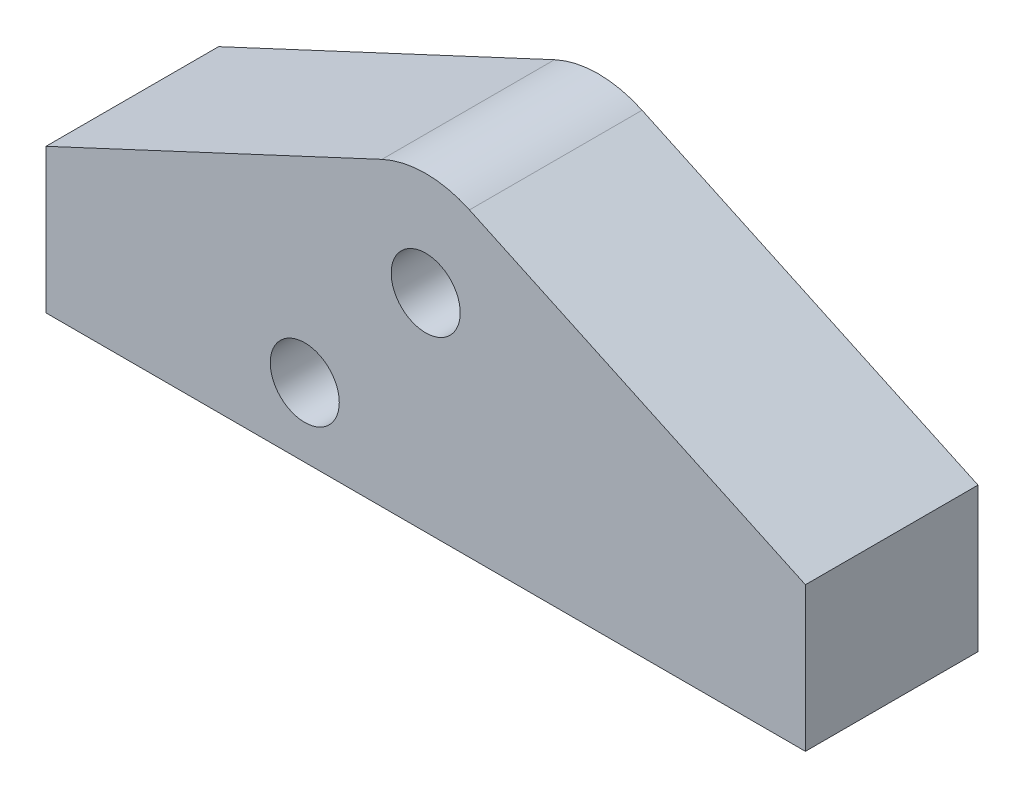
ISO-10303-21;
HEADER;
FILE_DESCRIPTION(('STEP AP214'),'2;1');
FILE_NAME('part.step','',(''),(''),'','','');
FILE_SCHEMA(('AUTOMOTIVE_DESIGN { 1 0 10303 214 1 1 1 1 }'));
ENDSEC;
DATA;
#1=APPLICATION_CONTEXT('core data for automotive mechanical design processes');
#2=APPLICATION_PROTOCOL_DEFINITION('international standard','automotive_design',2000,#1);
#3=PRODUCT_CONTEXT('',#1,'mechanical');
#4=PRODUCT('Part','Part','',(#3));
#5=PRODUCT_RELATED_PRODUCT_CATEGORY('part','',(#4));
#6=PRODUCT_DEFINITION_FORMATION('','',#4);
#7=PRODUCT_DEFINITION_CONTEXT('part definition',#1,'design');
#8=PRODUCT_DEFINITION('design','',#6,#7);
#9=PRODUCT_DEFINITION_SHAPE('','',#8);
#10=(LENGTH_UNIT() NAMED_UNIT(*) SI_UNIT(.MILLI.,.METRE.));
#11=(NAMED_UNIT(*) PLANE_ANGLE_UNIT() SI_UNIT($,.RADIAN.));
#12=(NAMED_UNIT(*) SI_UNIT($,.STERADIAN.) SOLID_ANGLE_UNIT());
#13=UNCERTAINTY_MEASURE_WITH_UNIT(LENGTH_MEASURE(1.E-05),#10,'distance_accuracy_value','');
#14=(GEOMETRIC_REPRESENTATION_CONTEXT(3) GLOBAL_UNCERTAINTY_ASSIGNED_CONTEXT((#13)) GLOBAL_UNIT_ASSIGNED_CONTEXT((#10,
#11,#12)) REPRESENTATION_CONTEXT('',''));
#15=CARTESIAN_POINT('',(0.,0.,0.));
#16=DIRECTION('',(0.,0.,1.));
#17=DIRECTION('',(1.,0.,0.));
#18=AXIS2_PLACEMENT_3D('',#15,#16,#17);
#19=CARTESIAN_POINT('',(-34.925,-19.05,-6.35));
#20=DIRECTION('',(-1.,0.,0.));
#21=DIRECTION('',(0.,0.,1.));
#22=AXIS2_PLACEMENT_3D('',#19,#20,#21);
#23=PLANE('',#22);
#24=DIRECTION('',(0.,0.,1.));
#25=VECTOR('',#24,1.);
#26=CARTESIAN_POINT('',(-34.925,-19.05,-6.35));
#27=LINE('',#26,#25);
#28=CARTESIAN_POINT('',(-34.925,-19.05,-6.35));
#29=VERTEX_POINT('',#28);
#30=CARTESIAN_POINT('',(-34.925,-19.05,9.525));
#31=VERTEX_POINT('',#30);
#32=EDGE_CURVE('E36',#29,#31,#27,.T.);
#33=ORIENTED_EDGE('',*,*,#32,.T.);
#34=DIRECTION('',(0.,-1.,0.));
#35=VECTOR('',#34,1.);
#36=CARTESIAN_POINT('',(-34.925,-19.05,9.525));
#37=LINE('',#36,#35);
#38=CARTESIAN_POINT('',(-34.925,-5.77612028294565,9.525));
#39=VERTEX_POINT('',#38);
#40=EDGE_CURVE('E85',#39,#31,#37,.T.);
#41=ORIENTED_EDGE('',*,*,#40,.F.);
#42=DIRECTION('',(0.,0.,1.));
#43=VECTOR('',#42,1.);
#44=CARTESIAN_POINT('',(-34.925,-5.77612028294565,-6.35));
#45=LINE('',#44,#43);
#46=CARTESIAN_POINT('',(-34.925,-5.77612028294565,-6.35));
#47=VERTEX_POINT('',#46);
#48=EDGE_CURVE('E11',#47,#39,#45,.T.);
#49=ORIENTED_EDGE('',*,*,#48,.F.);
#50=DIRECTION('',(0.,-1.,0.));
#51=VECTOR('',#50,1.);
#52=CARTESIAN_POINT('',(-34.925,-19.05,-6.35));
#53=LINE('',#52,#51);
#54=EDGE_CURVE('E86',#47,#29,#53,.T.);
#55=ORIENTED_EDGE('',*,*,#54,.T.);
#56=EDGE_LOOP('',(#33,#41,#49,#55));
#57=FACE_BOUND('',#56,.T.);
#58=ADVANCED_FACE('F33',(#57),#23,.T.);
#59=CARTESIAN_POINT('',(-34.925,-5.77612028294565,-6.35));
#60=DIRECTION('',(-0.422618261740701,0.906307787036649,0.));
#61=DIRECTION('',(-0.906307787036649,-0.422618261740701,0.));
#62=AXIS2_PLACEMENT_3D('',#59,#60,#61);
#63=PLANE('',#62);
#64=ORIENTED_EDGE('',*,*,#48,.T.);
#65=DIRECTION('',(-0.906307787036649,-0.422618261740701,0.));
#66=VECTOR('',#65,1.);
#67=CARTESIAN_POINT('',(-34.925,-5.77612028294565,9.525));
#68=LINE('',#67,#66);
#69=CARTESIAN_POINT('',(-4.02543894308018,8.63258167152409,9.525));
#70=VERTEX_POINT('',#69);
#71=EDGE_CURVE('E104',#70,#39,#68,.T.);
#72=ORIENTED_EDGE('',*,*,#71,.F.);
#73=DIRECTION('',(0.,0.,1.));
#74=VECTOR('',#73,1.);
#75=CARTESIAN_POINT('',(-4.02543894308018,8.63258167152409,-6.35));
#76=LINE('',#75,#74);
#77=CARTESIAN_POINT('',(-4.02543894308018,8.63258167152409,-6.35));
#78=VERTEX_POINT('',#77);
#79=EDGE_CURVE('E41',#78,#70,#76,.T.);
#80=ORIENTED_EDGE('',*,*,#79,.F.);
#81=DIRECTION('',(-0.906307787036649,-0.422618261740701,0.));
#82=VECTOR('',#81,1.);
#83=CARTESIAN_POINT('',(-34.925,-5.77612028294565,-6.35));
#84=LINE('',#83,#82);
#85=EDGE_CURVE('E91',#78,#47,#84,.T.);
#86=ORIENTED_EDGE('',*,*,#85,.T.);
#87=EDGE_LOOP('',(#64,#72,#80,#86));
#88=FACE_BOUND('',#87,.T.);
#89=ADVANCED_FACE('F155',(#88),#63,.T.);
#90=CARTESIAN_POINT('',(0.,0.,-6.35));
#91=DIRECTION('',(0.,0.,1.));
#92=DIRECTION('',(1.,0.,0.));
#93=AXIS2_PLACEMENT_3D('',#90,#91,#92);
#94=CYLINDRICAL_SURFACE('',#93,9.525);
#95=ORIENTED_EDGE('',*,*,#79,.T.);
#96=CARTESIAN_POINT('',(0.,0.,9.525));
#97=DIRECTION('',(0.,0.,1.));
#98=DIRECTION('',(1.,0.,0.));
#99=AXIS2_PLACEMENT_3D('',#96,#97,#98);
#100=CIRCLE('',#99,9.525);
#101=CARTESIAN_POINT('',(4.02543894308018,8.63258167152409,9.525));
#102=VERTEX_POINT('',#101);
#103=EDGE_CURVE('E116',#102,#70,#100,.T.);
#104=ORIENTED_EDGE('',*,*,#103,.F.);
#105=DIRECTION('',(0.,0.,1.));
#106=VECTOR('',#105,1.);
#107=CARTESIAN_POINT('',(4.02543894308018,8.63258167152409,-6.35));
#108=LINE('',#107,#106);
#109=CARTESIAN_POINT('',(4.02543894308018,8.63258167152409,-6.35));
#110=VERTEX_POINT('',#109);
#111=EDGE_CURVE('E138',#110,#102,#108,.T.);
#112=ORIENTED_EDGE('',*,*,#111,.F.);
#113=CARTESIAN_POINT('',(0.,0.,-6.35));
#114=DIRECTION('',(0.,0.,1.));
#115=DIRECTION('',(1.,0.,0.));
#116=AXIS2_PLACEMENT_3D('',#113,#114,#115);
#117=CIRCLE('',#116,9.525);
#118=EDGE_CURVE('E134',#110,#78,#117,.T.);
#119=ORIENTED_EDGE('',*,*,#118,.T.);
#120=EDGE_LOOP('',(#95,#104,#112,#119));
#121=FACE_BOUND('',#120,.T.);
#122=ADVANCED_FACE('F151',(#121),#94,.T.);
#123=CARTESIAN_POINT('',(34.925,-5.77612028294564,-6.35));
#124=DIRECTION('',(0.422618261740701,0.906307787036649,0.));
#125=DIRECTION('',(-0.906307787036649,0.422618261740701,0.));
#126=AXIS2_PLACEMENT_3D('',#123,#124,#125);
#127=PLANE('',#126);
#128=ORIENTED_EDGE('',*,*,#111,.T.);
#129=DIRECTION('',(-0.906307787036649,0.422618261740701,0.));
#130=VECTOR('',#129,1.);
#131=CARTESIAN_POINT('',(34.925,-5.77612028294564,9.525));
#132=LINE('',#131,#130);
#133=CARTESIAN_POINT('',(34.925,-5.77612028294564,9.525));
#134=VERTEX_POINT('',#133);
#135=EDGE_CURVE('E113',#134,#102,#132,.T.);
#136=ORIENTED_EDGE('',*,*,#135,.F.);
#137=DIRECTION('',(0.,0.,1.));
#138=VECTOR('',#137,1.);
#139=CARTESIAN_POINT('',(34.925,-5.77612028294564,-6.35));
#140=LINE('',#139,#138);
#141=CARTESIAN_POINT('',(34.925,-5.77612028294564,-6.35));
#142=VERTEX_POINT('',#141);
#143=EDGE_CURVE('E140',#142,#134,#140,.T.);
#144=ORIENTED_EDGE('',*,*,#143,.F.);
#145=DIRECTION('',(-0.906307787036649,0.422618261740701,0.));
#146=VECTOR('',#145,1.);
#147=CARTESIAN_POINT('',(34.925,-5.77612028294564,-6.35));
#148=LINE('',#147,#146);
#149=EDGE_CURVE('E131',#142,#110,#148,.T.);
#150=ORIENTED_EDGE('',*,*,#149,.T.);
#151=EDGE_LOOP('',(#128,#136,#144,#150));
#152=FACE_BOUND('',#151,.T.);
#153=ADVANCED_FACE('F148',(#152),#127,.T.);
#154=CARTESIAN_POINT('',(34.925,-19.05,-6.35));
#155=DIRECTION('',(1.,0.,0.));
#156=DIRECTION('',(0.,0.,-1.));
#157=AXIS2_PLACEMENT_3D('',#154,#155,#156);
#158=PLANE('',#157);
#159=ORIENTED_EDGE('',*,*,#143,.T.);
#160=DIRECTION('',(0.,1.,0.));
#161=VECTOR('',#160,1.);
#162=CARTESIAN_POINT('',(34.925,-19.05,9.525));
#163=LINE('',#162,#161);
#164=CARTESIAN_POINT('',(34.925,-19.05,9.525));
#165=VERTEX_POINT('',#164);
#166=EDGE_CURVE('E98',#165,#134,#163,.T.);
#167=ORIENTED_EDGE('',*,*,#166,.F.);
#168=DIRECTION('',(0.,0.,1.));
#169=VECTOR('',#168,1.);
#170=CARTESIAN_POINT('',(34.925,-19.05,-6.35));
#171=LINE('',#170,#169);
#172=CARTESIAN_POINT('',(34.925,-19.05,-6.35));
#173=VERTEX_POINT('',#172);
#174=EDGE_CURVE('E90',#173,#165,#171,.T.);
#175=ORIENTED_EDGE('',*,*,#174,.F.);
#176=DIRECTION('',(0.,1.,0.));
#177=VECTOR('',#176,1.);
#178=CARTESIAN_POINT('',(34.925,-19.05,-6.35));
#179=LINE('',#178,#177);
#180=EDGE_CURVE('E128',#173,#142,#179,.T.);
#181=ORIENTED_EDGE('',*,*,#180,.T.);
#182=EDGE_LOOP('',(#159,#167,#175,#181));
#183=FACE_BOUND('',#182,.T.);
#184=ADVANCED_FACE('F142',(#183),#158,.T.);
#185=CARTESIAN_POINT('',(-34.925,-19.05,-6.35));
#186=DIRECTION('',(0.,-1.,0.));
#187=DIRECTION('',(1.,0.,0.));
#188=AXIS2_PLACEMENT_3D('',#185,#186,#187);
#189=PLANE('',#188);
#190=CARTESIAN_POINT('',(25.4,-19.05,0.));
#191=DIRECTION('',(0.,-1.,0.));
#192=DIRECTION('',(1.,0.,0.));
#193=AXIS2_PLACEMENT_3D('',#190,#191,#192);
#194=CIRCLE('',#193,3.175);
#195=CARTESIAN_POINT('',(28.575,-19.05,0.));
#196=VERTEX_POINT('',#195);
#197=EDGE_CURVE('E179',#196,#196,#194,.T.);
#198=ORIENTED_EDGE('',*,*,#197,.F.);
#199=EDGE_LOOP('',(#198));
#200=FACE_BOUND('',#199,.T.);
#201=CARTESIAN_POINT('',(-25.4,-19.05,0.));
#202=DIRECTION('',(0.,-1.,0.));
#203=DIRECTION('',(1.,0.,0.));
#204=AXIS2_PLACEMENT_3D('',#201,#202,#203);
#205=CIRCLE('',#204,3.175);
#206=CARTESIAN_POINT('',(-22.225,-19.05,0.));
#207=VERTEX_POINT('',#206);
#208=EDGE_CURVE('E182',#207,#207,#205,.T.);
#209=ORIENTED_EDGE('',*,*,#208,.F.);
#210=EDGE_LOOP('',(#209));
#211=FACE_BOUND('',#210,.T.);
#212=ORIENTED_EDGE('',*,*,#174,.T.);
#213=DIRECTION('',(1.,0.,0.));
#214=VECTOR('',#213,1.);
#215=CARTESIAN_POINT('',(-34.925,-19.05,9.525));
#216=LINE('',#215,#214);
#217=EDGE_CURVE('E93',#31,#165,#216,.T.);
#218=ORIENTED_EDGE('',*,*,#217,.F.);
#219=ORIENTED_EDGE('',*,*,#32,.F.);
#220=DIRECTION('',(1.,0.,0.));
#221=VECTOR('',#220,1.);
#222=CARTESIAN_POINT('',(-34.925,-19.05,-6.35));
#223=LINE('',#222,#221);
#224=EDGE_CURVE('E126',#29,#173,#223,.T.);
#225=ORIENTED_EDGE('',*,*,#224,.T.);
#226=EDGE_LOOP('',(#212,#218,#219,#225));
#227=FACE_BOUND('',#226,.T.);
#228=ADVANCED_FACE('F94',(#200,#211,#227),#189,.T.);
#229=CARTESIAN_POINT('',(0.,0.,-6.35));
#230=DIRECTION('',(0.,0.,1.));
#231=DIRECTION('',(1.,0.,0.));
#232=AXIS2_PLACEMENT_3D('',#229,#230,#231);
#233=PLANE('',#232);
#234=CARTESIAN_POINT('',(-11.1252,-12.7,-6.35));
#235=DIRECTION('',(0.,0.,1.));
#236=DIRECTION('',(1.,0.,0.));
#237=AXIS2_PLACEMENT_3D('',#234,#235,#236);
#238=CIRCLE('',#237,3.175);
#239=CARTESIAN_POINT('',(-7.9502,-12.7,-6.35));
#240=VERTEX_POINT('',#239);
#241=EDGE_CURVE('E119',#240,#240,#238,.T.);
#242=ORIENTED_EDGE('',*,*,#241,.T.);
#243=EDGE_LOOP('',(#242));
#244=FACE_BOUND('',#243,.T.);
#245=CARTESIAN_POINT('',(0.,0.,-6.35));
#246=DIRECTION('',(0.,0.,1.));
#247=DIRECTION('',(1.,0.,0.));
#248=AXIS2_PLACEMENT_3D('',#245,#246,#247);
#249=CIRCLE('',#248,3.175);
#250=CARTESIAN_POINT('',(3.175,0.,-6.35));
#251=VERTEX_POINT('',#250);
#252=EDGE_CURVE('E122',#251,#251,#249,.T.);
#253=ORIENTED_EDGE('',*,*,#252,.T.);
#254=EDGE_LOOP('',(#253));
#255=FACE_BOUND('',#254,.T.);
#256=ORIENTED_EDGE('',*,*,#54,.F.);
#257=ORIENTED_EDGE('',*,*,#85,.F.);
#258=ORIENTED_EDGE('',*,*,#118,.F.);
#259=ORIENTED_EDGE('',*,*,#149,.F.);
#260=ORIENTED_EDGE('',*,*,#180,.F.);
#261=ORIENTED_EDGE('',*,*,#224,.F.);
#262=EDGE_LOOP('',(#256,#257,#258,#259,#260,#261));
#263=FACE_BOUND('',#262,.T.);
#264=ADVANCED_FACE('F154',(#244,#255,#263),#233,.F.);
#265=CARTESIAN_POINT('',(0.,0.,-6.35));
#266=DIRECTION('',(0.,0.,1.));
#267=DIRECTION('',(1.,0.,0.));
#268=AXIS2_PLACEMENT_3D('',#265,#266,#267);
#269=CYLINDRICAL_SURFACE('',#268,3.175);
#270=ORIENTED_EDGE('',*,*,#252,.F.);
#271=EDGE_LOOP('',(#270));
#272=FACE_BOUND('',#271,.T.);
#273=CARTESIAN_POINT('',(0.,0.,9.525));
#274=DIRECTION('',(0.,0.,1.));
#275=DIRECTION('',(1.,0.,0.));
#276=AXIS2_PLACEMENT_3D('',#273,#274,#275);
#277=CIRCLE('',#276,3.175);
#278=CARTESIAN_POINT('',(3.175,0.,9.525));
#279=VERTEX_POINT('',#278);
#280=EDGE_CURVE('E105',#279,#279,#277,.T.);
#281=ORIENTED_EDGE('',*,*,#280,.T.);
#282=EDGE_LOOP('',(#281));
#283=FACE_BOUND('',#282,.T.);
#284=ADVANCED_FACE('F174',(#272,#283),#269,.F.);
#285=CARTESIAN_POINT('',(-11.1252,-12.7,-6.35));
#286=DIRECTION('',(0.,0.,1.));
#287=DIRECTION('',(1.,0.,0.));
#288=AXIS2_PLACEMENT_3D('',#285,#286,#287);
#289=CYLINDRICAL_SURFACE('',#288,3.175);
#290=ORIENTED_EDGE('',*,*,#241,.F.);
#291=EDGE_LOOP('',(#290));
#292=FACE_BOUND('',#291,.T.);
#293=CARTESIAN_POINT('',(-11.1252,-12.7,9.525));
#294=DIRECTION('',(0.,0.,1.));
#295=DIRECTION('',(1.,0.,0.));
#296=AXIS2_PLACEMENT_3D('',#293,#294,#295);
#297=CIRCLE('',#296,3.175);
#298=CARTESIAN_POINT('',(-7.9502,-12.7,9.525));
#299=VERTEX_POINT('',#298);
#300=EDGE_CURVE('E108',#299,#299,#297,.T.);
#301=ORIENTED_EDGE('',*,*,#300,.T.);
#302=EDGE_LOOP('',(#301));
#303=FACE_BOUND('',#302,.T.);
#304=ADVANCED_FACE('F195',(#292,#303),#289,.F.);
#305=CARTESIAN_POINT('',(0.,0.,9.525));
#306=DIRECTION('',(0.,0.,1.));
#307=DIRECTION('',(1.,0.,0.));
#308=AXIS2_PLACEMENT_3D('',#305,#306,#307);
#309=PLANE('',#308);
#310=ORIENTED_EDGE('',*,*,#280,.F.);
#311=EDGE_LOOP('',(#310));
#312=FACE_BOUND('',#311,.T.);
#313=ORIENTED_EDGE('',*,*,#40,.T.);
#314=ORIENTED_EDGE('',*,*,#217,.T.);
#315=ORIENTED_EDGE('',*,*,#166,.T.);
#316=ORIENTED_EDGE('',*,*,#135,.T.);
#317=ORIENTED_EDGE('',*,*,#103,.T.);
#318=ORIENTED_EDGE('',*,*,#71,.T.);
#319=EDGE_LOOP('',(#313,#314,#315,#316,#317,#318));
#320=FACE_BOUND('',#319,.T.);
#321=ORIENTED_EDGE('',*,*,#300,.F.);
#322=EDGE_LOOP('',(#321));
#323=FACE_BOUND('',#322,.T.);
#324=ADVANCED_FACE('F101',(#312,#320,#323),#309,.T.);
#325=CARTESIAN_POINT('',(-25.4,-3.175,0.));
#326=DIRECTION('',(0.,-1.,0.));
#327=DIRECTION('',(1.,0.,0.));
#328=AXIS2_PLACEMENT_3D('',#325,#326,#327);
#329=CYLINDRICAL_SURFACE('',#328,3.175);
#330=CARTESIAN_POINT('',(-25.4,-3.175,0.));
#331=DIRECTION('',(0.,-1.,0.));
#332=DIRECTION('',(1.,0.,0.));
#333=AXIS2_PLACEMENT_3D('',#330,#331,#332);
#334=CIRCLE('',#333,3.175);
#335=CARTESIAN_POINT('',(-22.225,-3.175,0.));
#336=VERTEX_POINT('',#335);
#337=EDGE_CURVE('E184',#336,#336,#334,.T.);
#338=ORIENTED_EDGE('',*,*,#337,.F.);
#339=EDGE_LOOP('',(#338));
#340=FACE_BOUND('',#339,.T.);
#341=ORIENTED_EDGE('',*,*,#208,.T.);
#342=EDGE_LOOP('',(#341));
#343=FACE_BOUND('',#342,.T.);
#344=ADVANCED_FACE('F197',(#340,#343),#329,.F.);
#345=CARTESIAN_POINT('',(-25.4,-3.175,0.));
#346=DIRECTION('',(0.,-1.,0.));
#347=DIRECTION('',(1.,0.,0.));
#348=AXIS2_PLACEMENT_3D('',#345,#346,#347);
#349=PLANE('',#348);
#350=ORIENTED_EDGE('',*,*,#337,.T.);
#351=EDGE_LOOP('',(#350));
#352=FACE_BOUND('',#351,.T.);
#353=ADVANCED_FACE('F204',(#352),#349,.T.);
#354=CARTESIAN_POINT('',(25.4,-3.17499999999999,0.));
#355=DIRECTION('',(0.,-1.,0.));
#356=DIRECTION('',(1.,0.,0.));
#357=AXIS2_PLACEMENT_3D('',#354,#355,#356);
#358=CYLINDRICAL_SURFACE('',#357,3.175);
#359=CARTESIAN_POINT('',(25.4,-3.17499999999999,0.));
#360=DIRECTION('',(0.,-1.,0.));
#361=DIRECTION('',(1.,0.,0.));
#362=AXIS2_PLACEMENT_3D('',#359,#360,#361);
#363=CIRCLE('',#362,3.175);
#364=CARTESIAN_POINT('',(28.575,-3.17499999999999,0.));
#365=VERTEX_POINT('',#364);
#366=EDGE_CURVE('E185',#365,#365,#363,.T.);
#367=ORIENTED_EDGE('',*,*,#366,.F.);
#368=EDGE_LOOP('',(#367));
#369=FACE_BOUND('',#368,.T.);
#370=ORIENTED_EDGE('',*,*,#197,.T.);
#371=EDGE_LOOP('',(#370));
#372=FACE_BOUND('',#371,.T.);
#373=ADVANCED_FACE('F249',(#369,#372),#358,.F.);
#374=CARTESIAN_POINT('',(25.4,-3.17499999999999,0.));
#375=DIRECTION('',(0.,-1.,0.));
#376=DIRECTION('',(1.,0.,0.));
#377=AXIS2_PLACEMENT_3D('',#374,#375,#376);
#378=PLANE('',#377);
#379=ORIENTED_EDGE('',*,*,#366,.T.);
#380=EDGE_LOOP('',(#379));
#381=FACE_BOUND('',#380,.T.);
#382=ADVANCED_FACE('F258',(#381),#378,.T.);
#383=CLOSED_SHELL('',(#58,#89,#122,#153,#184,#228,#264,#284,#304,#324,#344,#353,#373,#382));
#384=MANIFOLD_SOLID_BREP('B2',#383);
#385=ADVANCED_BREP_SHAPE_REPRESENTATION('',(#18,#384),#14);
#386=SHAPE_DEFINITION_REPRESENTATION(#9,#385);
ENDSEC;
END-ISO-10303-21;
